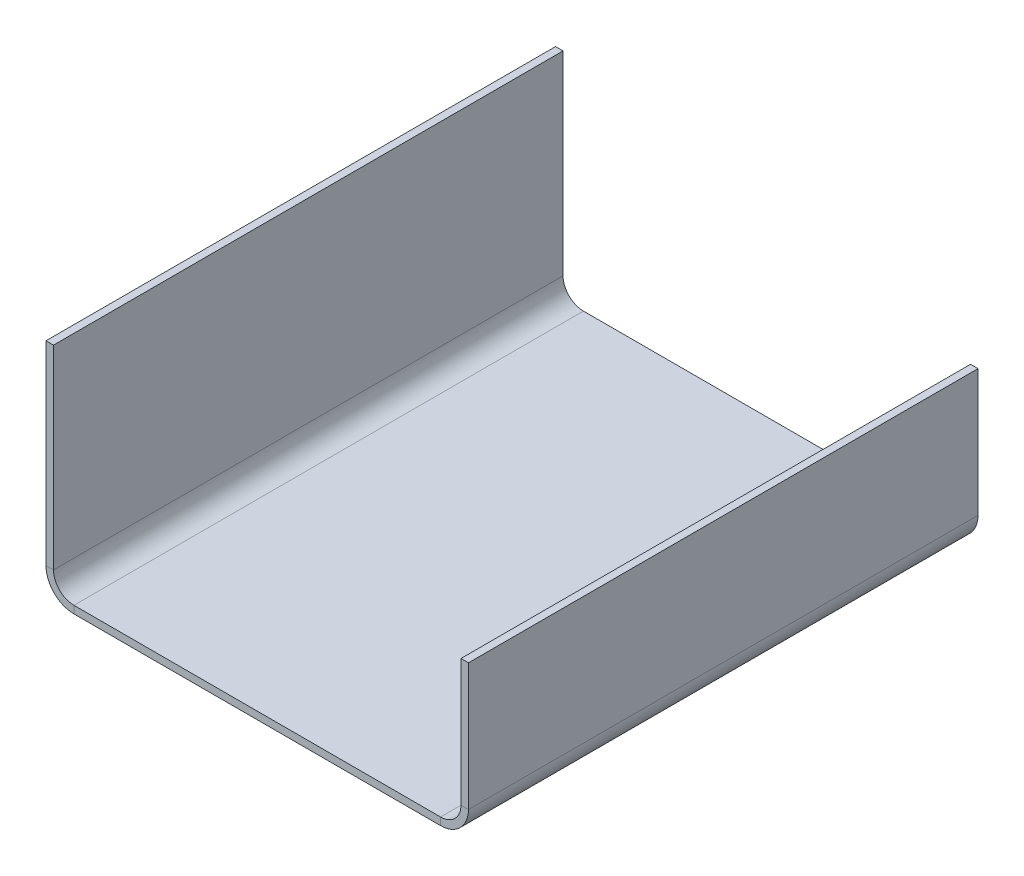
ISO-10303-21;
HEADER;
FILE_DESCRIPTION(('STEP AP214'),'2;1');
FILE_NAME('part.step','',(''),(''),'','','');
FILE_SCHEMA(('AUTOMOTIVE_DESIGN { 1 0 10303 214 1 1 1 1 }'));
ENDSEC;
DATA;
#1=APPLICATION_CONTEXT('core data for automotive mechanical design processes');
#2=APPLICATION_PROTOCOL_DEFINITION('international standard','automotive_design',2000,#1);
#3=PRODUCT_CONTEXT('',#1,'mechanical');
#4=PRODUCT('Part','Part','',(#3));
#5=PRODUCT_RELATED_PRODUCT_CATEGORY('part','',(#4));
#6=PRODUCT_DEFINITION_FORMATION('','',#4);
#7=PRODUCT_DEFINITION_CONTEXT('part definition',#1,'design');
#8=PRODUCT_DEFINITION('design','',#6,#7);
#9=PRODUCT_DEFINITION_SHAPE('','',#8);
#10=(LENGTH_UNIT() NAMED_UNIT(*) SI_UNIT(.MILLI.,.METRE.));
#11=(NAMED_UNIT(*) PLANE_ANGLE_UNIT() SI_UNIT($,.RADIAN.));
#12=(NAMED_UNIT(*) SI_UNIT($,.STERADIAN.) SOLID_ANGLE_UNIT());
#13=UNCERTAINTY_MEASURE_WITH_UNIT(LENGTH_MEASURE(1.E-05),#10,'distance_accuracy_value','');
#14=(GEOMETRIC_REPRESENTATION_CONTEXT(3) GLOBAL_UNCERTAINTY_ASSIGNED_CONTEXT((#13)) GLOBAL_UNIT_ASSIGNED_CONTEXT((#10,
#11,#12)) REPRESENTATION_CONTEXT('',''));
#15=CARTESIAN_POINT('',(0.,0.,0.));
#16=DIRECTION('',(0.,0.,1.));
#17=DIRECTION('',(1.,0.,0.));
#18=AXIS2_PLACEMENT_3D('',#15,#16,#17);
#19=CARTESIAN_POINT('',(0.,0.7366,-50.));
#20=DIRECTION('',(0.,-1.,0.));
#21=DIRECTION('',(0.,0.,-1.));
#22=AXIS2_PLACEMENT_3D('',#19,#20,#21);
#23=PLANE('',#22);
#24=DIRECTION('',(-1.,0.,0.));
#25=VECTOR('',#24,1.);
#26=CARTESIAN_POINT('',(0.,0.7366,-50.));
#27=LINE('',#26,#25);
#28=CARTESIAN_POINT('',(58.8110573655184,0.736599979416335,-50.));
#29=VERTEX_POINT('',#28);
#30=CARTESIAN_POINT('',(22.8298854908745,0.736600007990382,-50.));
#31=VERTEX_POINT('',#30);
#32=EDGE_CURVE('E38',#29,#31,#27,.T.);
#33=ORIENTED_EDGE('',*,*,#32,.T.);
#34=DIRECTION('',(0.,0.,1.));
#35=VECTOR('',#34,1.);
#36=CARTESIAN_POINT('',(22.8298854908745,0.7366,-50.));
#37=LINE('',#36,#35);
#38=CARTESIAN_POINT('',(22.8298854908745,0.736600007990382,0.));
#39=VERTEX_POINT('',#38);
#40=EDGE_CURVE('E234',#31,#39,#37,.T.);
#41=ORIENTED_EDGE('',*,*,#40,.T.);
#42=DIRECTION('',(1.,0.,0.));
#43=VECTOR('',#42,1.);
#44=CARTESIAN_POINT('',(0.,0.7366,0.));
#45=LINE('',#44,#43);
#46=CARTESIAN_POINT('',(58.8110573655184,0.7366,0.));
#47=VERTEX_POINT('',#46);
#48=EDGE_CURVE('E242',#39,#47,#45,.T.);
#49=ORIENTED_EDGE('',*,*,#48,.T.);
#50=DIRECTION('',(0.,0.,1.));
#51=VECTOR('',#50,1.);
#52=CARTESIAN_POINT('',(58.8110573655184,0.7366,-50.));
#53=LINE('',#52,#51);
#54=EDGE_CURVE('E223',#29,#47,#53,.T.);
#55=ORIENTED_EDGE('',*,*,#54,.F.);
#56=EDGE_LOOP('',(#33,#41,#49,#55));
#57=FACE_BOUND('',#56,.T.);
#58=ADVANCED_FACE('F34',(#57),#23,.F.);
#59=CARTESIAN_POINT('',(0.,0.7366,-50.));
#60=DIRECTION('',(0.,0.,1.));
#61=DIRECTION('',(1.,0.,0.));
#62=AXIS2_PLACEMENT_3D('',#59,#60,#61);
#63=PLANE('',#62);
#64=DIRECTION('',(-1.,0.,0.));
#65=VECTOR('',#64,1.);
#66=CARTESIAN_POINT('',(0.,0.,-50.));
#67=LINE('',#66,#65);
#68=CARTESIAN_POINT('',(58.8110573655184,0.,-50.));
#69=VERTEX_POINT('',#68);
#70=CARTESIAN_POINT('',(22.8298854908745,1.59807614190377E-08,-50.));
#71=VERTEX_POINT('',#70);
#72=EDGE_CURVE('E57',#69,#71,#67,.T.);
#73=ORIENTED_EDGE('',*,*,#72,.T.);
#74=DIRECTION('',(0.,1.,0.));
#75=VECTOR('',#74,1.);
#76=CARTESIAN_POINT('',(22.8298854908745,0.7366,-50.));
#77=LINE('',#76,#75);
#78=EDGE_CURVE('E237',#71,#31,#77,.T.);
#79=ORIENTED_EDGE('',*,*,#78,.T.);
#80=ORIENTED_EDGE('',*,*,#32,.F.);
#81=DIRECTION('',(0.,1.,0.));
#82=VECTOR('',#81,1.);
#83=CARTESIAN_POINT('',(58.8110573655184,0.7366,-50.));
#84=LINE('',#83,#82);
#85=EDGE_CURVE('E231',#69,#29,#84,.T.);
#86=ORIENTED_EDGE('',*,*,#85,.F.);
#87=EDGE_LOOP('',(#73,#79,#80,#86));
#88=FACE_BOUND('',#87,.T.);
#89=ADVANCED_FACE('F250',(#88),#63,.F.);
#90=CARTESIAN_POINT('',(0.,0.7366,0.));
#91=DIRECTION('',(0.,0.,-1.));
#92=DIRECTION('',(-1.,0.,0.));
#93=AXIS2_PLACEMENT_3D('',#90,#91,#92);
#94=PLANE('',#93);
#95=ORIENTED_EDGE('',*,*,#48,.F.);
#96=DIRECTION('',(0.,-1.,0.));
#97=VECTOR('',#96,1.);
#98=CARTESIAN_POINT('',(22.8298854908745,0.7366,0.));
#99=LINE('',#98,#97);
#100=CARTESIAN_POINT('',(22.8298854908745,0.,0.));
#101=VERTEX_POINT('',#100);
#102=EDGE_CURVE('E11',#39,#101,#99,.T.);
#103=ORIENTED_EDGE('',*,*,#102,.T.);
#104=DIRECTION('',(1.,0.,0.));
#105=VECTOR('',#104,1.);
#106=CARTESIAN_POINT('',(0.,0.,0.));
#107=LINE('',#106,#105);
#108=CARTESIAN_POINT('',(58.8110573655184,0.,0.));
#109=VERTEX_POINT('',#108);
#110=EDGE_CURVE('E222',#101,#109,#107,.T.);
#111=ORIENTED_EDGE('',*,*,#110,.T.);
#112=DIRECTION('',(0.,-1.,0.));
#113=VECTOR('',#112,1.);
#114=CARTESIAN_POINT('',(58.8110573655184,0.7366,0.));
#115=LINE('',#114,#113);
#116=EDGE_CURVE('E226',#47,#109,#115,.T.);
#117=ORIENTED_EDGE('',*,*,#116,.F.);
#118=EDGE_LOOP('',(#95,#103,#111,#117));
#119=FACE_BOUND('',#118,.T.);
#120=ADVANCED_FACE('F36',(#119),#94,.F.);
#121=CARTESIAN_POINT('',(0.,0.,-50.));
#122=DIRECTION('',(0.,-1.,0.));
#123=DIRECTION('',(0.,0.,-1.));
#124=AXIS2_PLACEMENT_3D('',#121,#122,#123);
#125=PLANE('',#124);
#126=DIRECTION('',(0.,0.,1.));
#127=VECTOR('',#126,1.);
#128=CARTESIAN_POINT('',(22.8298854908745,0.,-50.));
#129=LINE('',#128,#127);
#130=EDGE_CURVE('E43',#71,#101,#129,.T.);
#131=ORIENTED_EDGE('',*,*,#130,.F.);
#132=ORIENTED_EDGE('',*,*,#72,.F.);
#133=DIRECTION('',(0.,0.,1.));
#134=VECTOR('',#133,1.);
#135=CARTESIAN_POINT('',(58.8110573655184,0.,-50.));
#136=LINE('',#135,#134);
#137=EDGE_CURVE('E229',#69,#109,#136,.T.);
#138=ORIENTED_EDGE('',*,*,#137,.T.);
#139=ORIENTED_EDGE('',*,*,#110,.F.);
#140=EDGE_LOOP('',(#131,#132,#138,#139));
#141=FACE_BOUND('',#140,.T.);
#142=ADVANCED_FACE('F283',(#141),#125,.T.);
#143=CARTESIAN_POINT('',(58.8110573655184,2.73660004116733,-50.));
#144=DIRECTION('',(0.,0.,1.));
#145=DIRECTION('',(1.,0.,0.));
#146=AXIS2_PLACEMENT_3D('',#143,#144,#145);
#147=PLANE('',#146);
#148=DIRECTION('',(-1.,0.,0.));
#149=VECTOR('',#148,1.);
#150=CARTESIAN_POINT('',(60.8110573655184,2.73660000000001,-50.));
#151=LINE('',#150,#149);
#152=CARTESIAN_POINT('',(61.5476573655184,2.73660000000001,-50.));
#153=VERTEX_POINT('',#152);
#154=CARTESIAN_POINT('',(60.8110573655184,2.73659999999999,-50.));
#155=VERTEX_POINT('',#154);
#156=EDGE_CURVE('E185',#153,#155,#151,.T.);
#157=ORIENTED_EDGE('',*,*,#156,.F.);
#158=CARTESIAN_POINT('',(58.8110573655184,2.7366,-50.));
#159=DIRECTION('',(0.,0.,-1.));
#160=DIRECTION('',(-1.,0.,0.));
#161=AXIS2_PLACEMENT_3D('',#158,#159,#160);
#162=CIRCLE('',#161,2.73660004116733);
#163=EDGE_CURVE('E184',#153,#69,#162,.T.);
#164=ORIENTED_EDGE('',*,*,#163,.T.);
#165=ORIENTED_EDGE('',*,*,#85,.T.);
#166=CARTESIAN_POINT('',(58.8110573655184,2.73660004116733,-50.));
#167=DIRECTION('',(0.,0.,-1.));
#168=DIRECTION('',(-1.,0.,0.));
#169=AXIS2_PLACEMENT_3D('',#166,#167,#168);
#170=CIRCLE('',#169,2.000000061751);
#171=EDGE_CURVE('E214',#155,#29,#170,.T.);
#172=ORIENTED_EDGE('',*,*,#171,.F.);
#173=EDGE_LOOP('',(#157,#164,#165,#172));
#174=FACE_BOUND('',#173,.T.);
#175=ADVANCED_FACE('F281',(#174),#147,.F.);
#176=CARTESIAN_POINT('',(58.8110573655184,2.73660004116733,0.));
#177=DIRECTION('',(0.,0.,-1.));
#178=DIRECTION('',(-1.,0.,0.));
#179=AXIS2_PLACEMENT_3D('',#176,#177,#178);
#180=PLANE('',#179);
#181=ORIENTED_EDGE('',*,*,#116,.T.);
#182=CARTESIAN_POINT('',(58.8110573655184,2.7366,0.));
#183=DIRECTION('',(0.,0.,-1.));
#184=DIRECTION('',(-1.,0.,0.));
#185=AXIS2_PLACEMENT_3D('',#182,#183,#184);
#186=CIRCLE('',#185,2.73660004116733);
#187=CARTESIAN_POINT('',(61.5476573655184,2.73660000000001,0.));
#188=VERTEX_POINT('',#187);
#189=EDGE_CURVE('E211',#109,#188,#186,.F.);
#190=ORIENTED_EDGE('',*,*,#189,.T.);
#191=DIRECTION('',(1.,0.,0.));
#192=VECTOR('',#191,1.);
#193=CARTESIAN_POINT('',(60.8110573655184,2.73660000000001,0.));
#194=LINE('',#193,#192);
#195=CARTESIAN_POINT('',(60.8110574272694,2.7366,0.));
#196=VERTEX_POINT('',#195);
#197=EDGE_CURVE('E192',#196,#188,#194,.T.);
#198=ORIENTED_EDGE('',*,*,#197,.F.);
#199=CARTESIAN_POINT('',(58.8110573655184,2.73660004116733,0.));
#200=DIRECTION('',(0.,0.,1.));
#201=DIRECTION('',(1.,0.,0.));
#202=AXIS2_PLACEMENT_3D('',#199,#200,#201);
#203=CIRCLE('',#202,2.000000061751);
#204=EDGE_CURVE('E219',#47,#196,#203,.T.);
#205=ORIENTED_EDGE('',*,*,#204,.F.);
#206=EDGE_LOOP('',(#181,#190,#198,#205));
#207=FACE_BOUND('',#206,.T.);
#208=ADVANCED_FACE('F289',(#207),#180,.F.);
#209=CARTESIAN_POINT('',(58.8110573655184,2.7366,25.1436122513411));
#210=DIRECTION('',(0.,0.,-1.));
#211=DIRECTION('',(-1.,0.,0.));
#212=AXIS2_PLACEMENT_3D('',#209,#210,#211);
#213=CYLINDRICAL_SURFACE('',#212,2.00000004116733);
#214=ORIENTED_EDGE('',*,*,#204,.T.);
#215=DIRECTION('',(0.,0.,1.));
#216=VECTOR('',#215,1.);
#217=CARTESIAN_POINT('',(60.8110573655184,2.73660000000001,-50.));
#218=LINE('',#217,#216);
#219=EDGE_CURVE('E199',#155,#196,#218,.T.);
#220=ORIENTED_EDGE('',*,*,#219,.F.);
#221=ORIENTED_EDGE('',*,*,#171,.T.);
#222=ORIENTED_EDGE('',*,*,#54,.T.);
#223=EDGE_LOOP('',(#214,#220,#221,#222));
#224=FACE_BOUND('',#223,.T.);
#225=ADVANCED_FACE('F297',(#224),#213,.F.);
#226=CARTESIAN_POINT('',(58.8110573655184,2.7366,25.1436122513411));
#227=DIRECTION('',(0.,0.,-1.));
#228=DIRECTION('',(-1.,0.,0.));
#229=AXIS2_PLACEMENT_3D('',#226,#227,#228);
#230=CYLINDRICAL_SURFACE('',#229,2.73660004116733);
#231=ORIENTED_EDGE('',*,*,#189,.F.);
#232=ORIENTED_EDGE('',*,*,#137,.F.);
#233=ORIENTED_EDGE('',*,*,#163,.F.);
#234=DIRECTION('',(0.,0.,1.));
#235=VECTOR('',#234,1.);
#236=CARTESIAN_POINT('',(61.5476573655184,2.73660000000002,-50.));
#237=LINE('',#236,#235);
#238=EDGE_CURVE('E180',#153,#188,#237,.T.);
#239=ORIENTED_EDGE('',*,*,#238,.T.);
#240=EDGE_LOOP('',(#231,#232,#233,#239));
#241=FACE_BOUND('',#240,.T.);
#242=ADVANCED_FACE('F316',(#241),#230,.T.);
#243=CARTESIAN_POINT('',(60.8110573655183,15.2054256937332,0.));
#244=DIRECTION('',(0.,-1.,0.));
#245=DIRECTION('',(0.,0.,1.));
#246=AXIS2_PLACEMENT_3D('',#243,#244,#245);
#247=PLANE('',#246);
#248=DIRECTION('',(0.,0.,-1.));
#249=VECTOR('',#248,1.);
#250=CARTESIAN_POINT('',(61.5476573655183,15.2054256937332,0.));
#251=LINE('',#250,#249);
#252=CARTESIAN_POINT('',(61.5476573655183,15.2054256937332,0.));
#253=VERTEX_POINT('',#252);
#254=CARTESIAN_POINT('',(61.5476573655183,15.2054256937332,-50.));
#255=VERTEX_POINT('',#254);
#256=EDGE_CURVE('E207',#253,#255,#251,.T.);
#257=ORIENTED_EDGE('',*,*,#256,.T.);
#258=DIRECTION('',(1.,0.,0.));
#259=VECTOR('',#258,1.);
#260=CARTESIAN_POINT('',(60.8110573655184,15.2054256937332,-50.));
#261=LINE('',#260,#259);
#262=CARTESIAN_POINT('',(60.8110573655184,15.2054256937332,-50.));
#263=VERTEX_POINT('',#262);
#264=EDGE_CURVE('E181',#263,#255,#261,.T.);
#265=ORIENTED_EDGE('',*,*,#264,.F.);
#266=DIRECTION('',(0.,0.,-1.));
#267=VECTOR('',#266,1.);
#268=CARTESIAN_POINT('',(60.8110573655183,15.2054256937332,0.));
#269=LINE('',#268,#267);
#270=CARTESIAN_POINT('',(60.8110573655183,15.2054256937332,0.));
#271=VERTEX_POINT('',#270);
#272=EDGE_CURVE('E195',#271,#263,#269,.T.);
#273=ORIENTED_EDGE('',*,*,#272,.F.);
#274=DIRECTION('',(1.,0.,0.));
#275=VECTOR('',#274,1.);
#276=CARTESIAN_POINT('',(60.8110573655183,15.2054256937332,0.));
#277=LINE('',#276,#275);
#278=EDGE_CURVE('E204',#271,#253,#277,.T.);
#279=ORIENTED_EDGE('',*,*,#278,.T.);
#280=EDGE_LOOP('',(#257,#265,#273,#279));
#281=FACE_BOUND('',#280,.T.);
#282=ADVANCED_FACE('F321',(#281),#247,.F.);
#283=CARTESIAN_POINT('',(60.8110573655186,-59.7945743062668,-50.));
#284=DIRECTION('',(1.,0.,0.));
#285=DIRECTION('',(0.,0.,-1.));
#286=AXIS2_PLACEMENT_3D('',#283,#284,#285);
#287=PLANE('',#286);
#288=DIRECTION('',(0.,-1.,0.));
#289=VECTOR('',#288,1.);
#290=CARTESIAN_POINT('',(60.8110573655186,-59.7945743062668,-50.));
#291=LINE('',#290,#289);
#292=EDGE_CURVE('E202',#263,#155,#291,.T.);
#293=ORIENTED_EDGE('',*,*,#292,.T.);
#294=ORIENTED_EDGE('',*,*,#219,.T.);
#295=DIRECTION('',(0.,1.,0.));
#296=VECTOR('',#295,1.);
#297=CARTESIAN_POINT('',(60.8110573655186,-59.7945743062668,0.));
#298=LINE('',#297,#296);
#299=EDGE_CURVE('E197',#196,#271,#298,.T.);
#300=ORIENTED_EDGE('',*,*,#299,.T.);
#301=ORIENTED_EDGE('',*,*,#272,.T.);
#302=EDGE_LOOP('',(#293,#294,#300,#301));
#303=FACE_BOUND('',#302,.T.);
#304=ADVANCED_FACE('F306',(#303),#287,.F.);
#305=CARTESIAN_POINT('',(60.8110573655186,-59.7945743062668,0.));
#306=DIRECTION('',(0.,0.,-1.));
#307=DIRECTION('',(0.,-1.,0.));
#308=AXIS2_PLACEMENT_3D('',#305,#306,#307);
#309=PLANE('',#308);
#310=ORIENTED_EDGE('',*,*,#299,.F.);
#311=ORIENTED_EDGE('',*,*,#197,.T.);
#312=DIRECTION('',(0.,1.,0.));
#313=VECTOR('',#312,1.);
#314=CARTESIAN_POINT('',(61.5476573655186,-59.7945743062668,0.));
#315=LINE('',#314,#313);
#316=EDGE_CURVE('E190',#188,#253,#315,.T.);
#317=ORIENTED_EDGE('',*,*,#316,.T.);
#318=ORIENTED_EDGE('',*,*,#278,.F.);
#319=EDGE_LOOP('',(#310,#311,#317,#318));
#320=FACE_BOUND('',#319,.T.);
#321=ADVANCED_FACE('F302',(#320),#309,.F.);
#322=CARTESIAN_POINT('',(61.5476573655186,-59.7945743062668,-50.));
#323=DIRECTION('',(1.,0.,0.));
#324=DIRECTION('',(0.,0.,-1.));
#325=AXIS2_PLACEMENT_3D('',#322,#323,#324);
#326=PLANE('',#325);
#327=ORIENTED_EDGE('',*,*,#238,.F.);
#328=DIRECTION('',(0.,-1.,0.));
#329=VECTOR('',#328,1.);
#330=CARTESIAN_POINT('',(61.5476573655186,-59.7945743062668,-50.));
#331=LINE('',#330,#329);
#332=EDGE_CURVE('E188',#255,#153,#331,.T.);
#333=ORIENTED_EDGE('',*,*,#332,.F.);
#334=ORIENTED_EDGE('',*,*,#256,.F.);
#335=ORIENTED_EDGE('',*,*,#316,.F.);
#336=EDGE_LOOP('',(#327,#333,#334,#335));
#337=FACE_BOUND('',#336,.T.);
#338=ADVANCED_FACE('F318',(#337),#326,.T.);
#339=CARTESIAN_POINT('',(60.8110573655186,-59.7945743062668,-50.));
#340=DIRECTION('',(0.,0.,1.));
#341=DIRECTION('',(0.,1.,0.));
#342=AXIS2_PLACEMENT_3D('',#339,#340,#341);
#343=PLANE('',#342);
#344=ORIENTED_EDGE('',*,*,#332,.T.);
#345=ORIENTED_EDGE('',*,*,#156,.T.);
#346=ORIENTED_EDGE('',*,*,#292,.F.);
#347=ORIENTED_EDGE('',*,*,#264,.T.);
#348=EDGE_LOOP('',(#344,#345,#346,#347));
#349=FACE_BOUND('',#348,.T.);
#350=ADVANCED_FACE('F311',(#349),#343,.F.);
#351=CARTESIAN_POINT('',(22.8298854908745,2.73659998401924,-50.));
#352=DIRECTION('',(0.,0.,1.));
#353=DIRECTION('',(1.,0.,0.));
#354=AXIS2_PLACEMENT_3D('',#351,#352,#353);
#355=PLANE('',#354);
#356=ORIENTED_EDGE('',*,*,#78,.F.);
#357=CARTESIAN_POINT('',(22.8298854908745,2.7366,-50.));
#358=DIRECTION('',(0.,0.,1.));
#359=DIRECTION('',(1.,0.,0.));
#360=AXIS2_PLACEMENT_3D('',#357,#358,#359);
#361=CIRCLE('',#360,2.73659998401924);
#362=CARTESIAN_POINT('',(20.0932854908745,2.73660000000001,-50.));
#363=VERTEX_POINT('',#362);
#364=EDGE_CURVE('E154',#71,#363,#361,.F.);
#365=ORIENTED_EDGE('',*,*,#364,.T.);
#366=DIRECTION('',(1.,0.,0.));
#367=VECTOR('',#366,1.);
#368=CARTESIAN_POINT('',(20.8298854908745,2.7366,-50.));
#369=LINE('',#368,#367);
#370=CARTESIAN_POINT('',(20.8298854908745,2.7366,-50.));
#371=VERTEX_POINT('',#370);
#372=EDGE_CURVE('E164',#363,#371,#369,.T.);
#373=ORIENTED_EDGE('',*,*,#372,.T.);
#374=CARTESIAN_POINT('',(22.8298854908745,2.73659998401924,-50.));
#375=DIRECTION('',(0.,0.,-1.));
#376=DIRECTION('',(-1.,0.,0.));
#377=AXIS2_PLACEMENT_3D('',#374,#375,#376);
#378=CIRCLE('',#377,1.99999997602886);
#379=EDGE_CURVE('E172',#31,#371,#378,.T.);
#380=ORIENTED_EDGE('',*,*,#379,.F.);
#381=EDGE_LOOP('',(#356,#365,#373,#380));
#382=FACE_BOUND('',#381,.T.);
#383=ADVANCED_FACE('F252',(#382),#355,.F.);
#384=CARTESIAN_POINT('',(22.8298854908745,2.73659998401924,0.));
#385=DIRECTION('',(0.,0.,-1.));
#386=DIRECTION('',(-1.,0.,0.));
#387=AXIS2_PLACEMENT_3D('',#384,#385,#386);
#388=PLANE('',#387);
#389=DIRECTION('',(-1.,0.,0.));
#390=VECTOR('',#389,1.);
#391=CARTESIAN_POINT('',(20.8298854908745,2.7366,0.));
#392=LINE('',#391,#390);
#393=CARTESIAN_POINT('',(20.8298855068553,2.73660000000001,0.));
#394=VERTEX_POINT('',#393);
#395=CARTESIAN_POINT('',(20.0932854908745,2.73660000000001,0.));
#396=VERTEX_POINT('',#395);
#397=EDGE_CURVE('E134',#394,#396,#392,.T.);
#398=ORIENTED_EDGE('',*,*,#397,.T.);
#399=CARTESIAN_POINT('',(22.8298854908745,2.7366,0.));
#400=DIRECTION('',(0.,0.,1.));
#401=DIRECTION('',(1.,0.,0.));
#402=AXIS2_PLACEMENT_3D('',#399,#400,#401);
#403=CIRCLE('',#402,2.73659998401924);
#404=EDGE_CURVE('E170',#396,#101,#403,.T.);
#405=ORIENTED_EDGE('',*,*,#404,.T.);
#406=ORIENTED_EDGE('',*,*,#102,.F.);
#407=CARTESIAN_POINT('',(22.8298854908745,2.73659998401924,0.));
#408=DIRECTION('',(0.,0.,1.));
#409=DIRECTION('',(1.,0.,0.));
#410=AXIS2_PLACEMENT_3D('',#407,#408,#409);
#411=CIRCLE('',#410,1.99999997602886);
#412=EDGE_CURVE('E177',#394,#39,#411,.T.);
#413=ORIENTED_EDGE('',*,*,#412,.F.);
#414=EDGE_LOOP('',(#398,#405,#406,#413));
#415=FACE_BOUND('',#414,.T.);
#416=ADVANCED_FACE('F260',(#415),#388,.F.);
#417=CARTESIAN_POINT('',(22.8298854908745,2.7366,-75.1436122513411));
#418=DIRECTION('',(0.,0.,1.));
#419=DIRECTION('',(1.,0.,0.));
#420=AXIS2_PLACEMENT_3D('',#417,#418,#419);
#421=CYLINDRICAL_SURFACE('',#420,1.99999998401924);
#422=ORIENTED_EDGE('',*,*,#412,.T.);
#423=ORIENTED_EDGE('',*,*,#40,.F.);
#424=ORIENTED_EDGE('',*,*,#379,.T.);
#425=DIRECTION('',(0.,0.,1.));
#426=VECTOR('',#425,1.);
#427=CARTESIAN_POINT('',(20.8298854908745,2.7366,-50.));
#428=LINE('',#427,#426);
#429=EDGE_CURVE('E168',#371,#394,#428,.T.);
#430=ORIENTED_EDGE('',*,*,#429,.T.);
#431=EDGE_LOOP('',(#422,#423,#424,#430));
#432=FACE_BOUND('',#431,.T.);
#433=ADVANCED_FACE('F263',(#432),#421,.F.);
#434=CARTESIAN_POINT('',(22.8298854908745,2.7366,-75.1436122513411));
#435=DIRECTION('',(0.,0.,1.));
#436=DIRECTION('',(1.,0.,0.));
#437=AXIS2_PLACEMENT_3D('',#434,#435,#436);
#438=CYLINDRICAL_SURFACE('',#437,2.73659998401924);
#439=ORIENTED_EDGE('',*,*,#404,.F.);
#440=DIRECTION('',(0.,0.,1.));
#441=VECTOR('',#440,1.);
#442=CARTESIAN_POINT('',(20.0932854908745,2.73660000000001,-50.));
#443=LINE('',#442,#441);
#444=EDGE_CURVE('E152',#363,#396,#443,.T.);
#445=ORIENTED_EDGE('',*,*,#444,.F.);
#446=ORIENTED_EDGE('',*,*,#364,.F.);
#447=ORIENTED_EDGE('',*,*,#130,.T.);
#448=EDGE_LOOP('',(#439,#445,#446,#447));
#449=FACE_BOUND('',#448,.T.);
#450=ADVANCED_FACE('F254',(#449),#438,.T.);
#451=CARTESIAN_POINT('',(20.8298854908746,21.8463685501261,0.));
#452=DIRECTION('',(0.,-1.,0.));
#453=DIRECTION('',(0.,0.,-1.));
#454=AXIS2_PLACEMENT_3D('',#451,#452,#453);
#455=PLANE('',#454);
#456=DIRECTION('',(0.,0.,1.));
#457=VECTOR('',#456,1.);
#458=CARTESIAN_POINT('',(20.0932854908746,21.8463685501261,0.));
#459=LINE('',#458,#457);
#460=CARTESIAN_POINT('',(20.0932854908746,21.8463685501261,-50.));
#461=VERTEX_POINT('',#460);
#462=CARTESIAN_POINT('',(20.0932854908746,21.8463685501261,0.));
#463=VERTEX_POINT('',#462);
#464=EDGE_CURVE('E150',#461,#463,#459,.T.);
#465=ORIENTED_EDGE('',*,*,#464,.T.);
#466=DIRECTION('',(-1.,0.,0.));
#467=VECTOR('',#466,1.);
#468=CARTESIAN_POINT('',(20.8298854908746,21.8463685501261,0.));
#469=LINE('',#468,#467);
#470=CARTESIAN_POINT('',(20.8298854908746,21.8463685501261,0.));
#471=VERTEX_POINT('',#470);
#472=EDGE_CURVE('E131',#471,#463,#469,.T.);
#473=ORIENTED_EDGE('',*,*,#472,.F.);
#474=DIRECTION('',(0.,0.,1.));
#475=VECTOR('',#474,1.);
#476=CARTESIAN_POINT('',(20.8298854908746,21.8463685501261,0.));
#477=LINE('',#476,#475);
#478=CARTESIAN_POINT('',(20.8298854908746,21.8463685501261,-50.));
#479=VERTEX_POINT('',#478);
#480=EDGE_CURVE('E138',#479,#471,#477,.T.);
#481=ORIENTED_EDGE('',*,*,#480,.F.);
#482=DIRECTION('',(-1.,0.,0.));
#483=VECTOR('',#482,1.);
#484=CARTESIAN_POINT('',(20.8298854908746,21.8463685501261,-50.));
#485=LINE('',#484,#483);
#486=EDGE_CURVE('E161',#479,#461,#485,.T.);
#487=ORIENTED_EDGE('',*,*,#486,.T.);
#488=EDGE_LOOP('',(#465,#473,#481,#487));
#489=FACE_BOUND('',#488,.T.);
#490=ADVANCED_FACE('F148',(#489),#455,.F.);
#491=CARTESIAN_POINT('',(20.8298854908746,21.8463685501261,-50.));
#492=DIRECTION('',(-1.,0.,0.));
#493=DIRECTION('',(0.,0.,-1.));
#494=AXIS2_PLACEMENT_3D('',#491,#492,#493);
#495=PLANE('',#494);
#496=ORIENTED_EDGE('',*,*,#429,.F.);
#497=DIRECTION('',(0.,1.,0.));
#498=VECTOR('',#497,1.);
#499=CARTESIAN_POINT('',(20.8298854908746,21.8463685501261,-50.));
#500=LINE('',#499,#498);
#501=EDGE_CURVE('E143',#371,#479,#500,.T.);
#502=ORIENTED_EDGE('',*,*,#501,.T.);
#503=ORIENTED_EDGE('',*,*,#480,.T.);
#504=DIRECTION('',(0.,-1.,0.));
#505=VECTOR('',#504,1.);
#506=CARTESIAN_POINT('',(20.8298854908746,21.8463685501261,0.));
#507=LINE('',#506,#505);
#508=EDGE_CURVE('E127',#471,#394,#507,.T.);
#509=ORIENTED_EDGE('',*,*,#508,.T.);
#510=EDGE_LOOP('',(#496,#502,#503,#509));
#511=FACE_BOUND('',#510,.T.);
#512=ADVANCED_FACE('F141',(#511),#495,.F.);
#513=CARTESIAN_POINT('',(20.8298854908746,21.8463685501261,-50.));
#514=DIRECTION('',(0.,0.,1.));
#515=DIRECTION('',(0.,-1.,0.));
#516=AXIS2_PLACEMENT_3D('',#513,#514,#515);
#517=PLANE('',#516);
#518=ORIENTED_EDGE('',*,*,#372,.F.);
#519=DIRECTION('',(0.,1.,0.));
#520=VECTOR('',#519,1.);
#521=CARTESIAN_POINT('',(20.0932854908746,21.8463685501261,-50.));
#522=LINE('',#521,#520);
#523=EDGE_CURVE('E137',#363,#461,#522,.T.);
#524=ORIENTED_EDGE('',*,*,#523,.T.);
#525=ORIENTED_EDGE('',*,*,#486,.F.);
#526=ORIENTED_EDGE('',*,*,#501,.F.);
#527=EDGE_LOOP('',(#518,#524,#525,#526));
#528=FACE_BOUND('',#527,.T.);
#529=ADVANCED_FACE('F265',(#528),#517,.F.);
#530=CARTESIAN_POINT('',(20.0932854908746,21.8463685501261,-50.));
#531=DIRECTION('',(-1.,0.,0.));
#532=DIRECTION('',(0.,0.,-1.));
#533=AXIS2_PLACEMENT_3D('',#530,#531,#532);
#534=PLANE('',#533);
#535=ORIENTED_EDGE('',*,*,#523,.F.);
#536=ORIENTED_EDGE('',*,*,#444,.T.);
#537=DIRECTION('',(0.,-1.,0.));
#538=VECTOR('',#537,1.);
#539=CARTESIAN_POINT('',(20.0932854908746,21.8463685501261,0.));
#540=LINE('',#539,#538);
#541=EDGE_CURVE('E151',#463,#396,#540,.T.);
#542=ORIENTED_EDGE('',*,*,#541,.F.);
#543=ORIENTED_EDGE('',*,*,#464,.F.);
#544=EDGE_LOOP('',(#535,#536,#542,#543));
#545=FACE_BOUND('',#544,.T.);
#546=ADVANCED_FACE('F256',(#545),#534,.T.);
#547=CARTESIAN_POINT('',(20.8298854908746,21.8463685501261,0.));
#548=DIRECTION('',(0.,0.,-1.));
#549=DIRECTION('',(0.,1.,0.));
#550=AXIS2_PLACEMENT_3D('',#547,#548,#549);
#551=PLANE('',#550);
#552=ORIENTED_EDGE('',*,*,#397,.F.);
#553=ORIENTED_EDGE('',*,*,#508,.F.);
#554=ORIENTED_EDGE('',*,*,#472,.T.);
#555=ORIENTED_EDGE('',*,*,#541,.T.);
#556=EDGE_LOOP('',(#552,#553,#554,#555));
#557=FACE_BOUND('',#556,.T.);
#558=ADVANCED_FACE('F129',(#557),#551,.F.);
#559=CLOSED_SHELL('',(#58,#89,#120,#142,#175,#208,#225,#242,#282,#304,#321,#338,#350,#383,#416,
#433,#450,#490,#512,#529,#546,#558));
#560=MANIFOLD_SOLID_BREP('B2',#559);
#561=ADVANCED_BREP_SHAPE_REPRESENTATION('',(#18,#560),#14);
#562=SHAPE_DEFINITION_REPRESENTATION(#9,#561);
ENDSEC;
END-ISO-10303-21;
